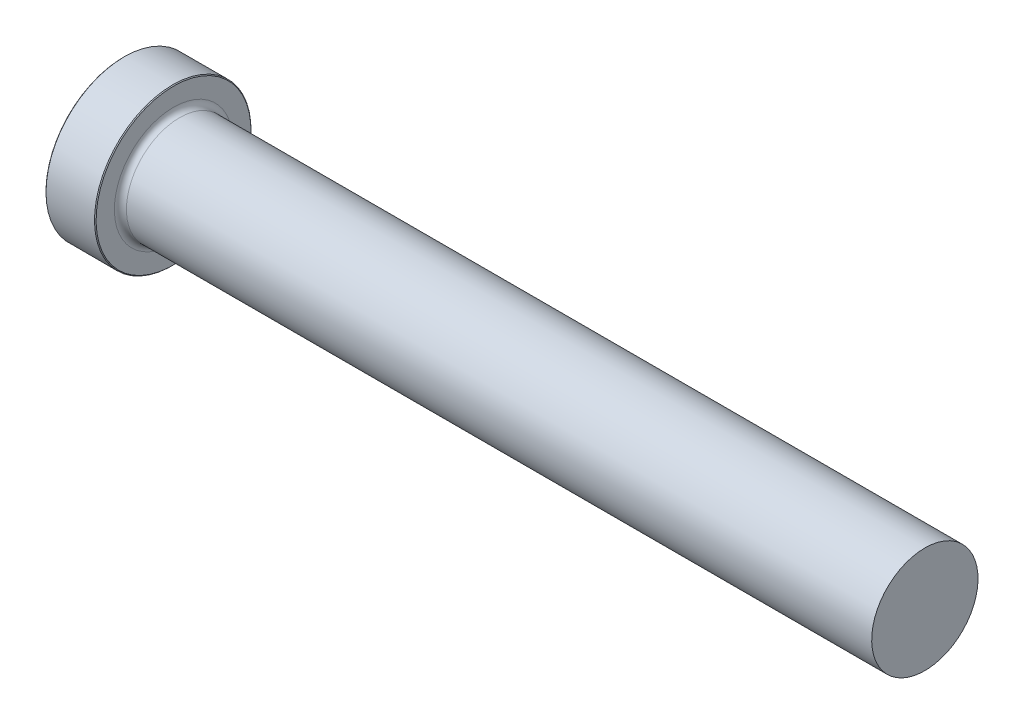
from build123d import *

# Parameters (mm, degrees)
CHAMFER1_SIZE = 0.1016


with BuildPart() as part:
    # Sketch1 → Revolve1 (revolve)
    with BuildSketch(Plane.XY):
        with BuildLine():
            Line((0, 0), (0, 9.921875))
            Line((0, 9.921875), (6.35, 9.921875))
            Line((6.35, 9.921875), (6.35, 7.502525))
            ThreePointArc((6.35, 7.502525), (6.573184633, 6.963709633), (7.112, 6.740525))
            Line((7.112, 6.740525), (101.6, 6.740525))
            Line((101.6, 6.740525), (101.6, 0))
            Line((101.6, 0), (0, 0))
        make_face()
    revolve(axis=Axis((101.6, 0, 0), (-1, 0, 0)))

    # Chamfer1
    chamfer1_edges = [part.edges().sort_by_distance(p)[0] for p in [
        (0, -9.921875, 0),
        (6.35, -9.921875, 0),
    ]]
    chamfer(chamfer1_edges, length=CHAMFER1_SIZE)


solid = part.part
